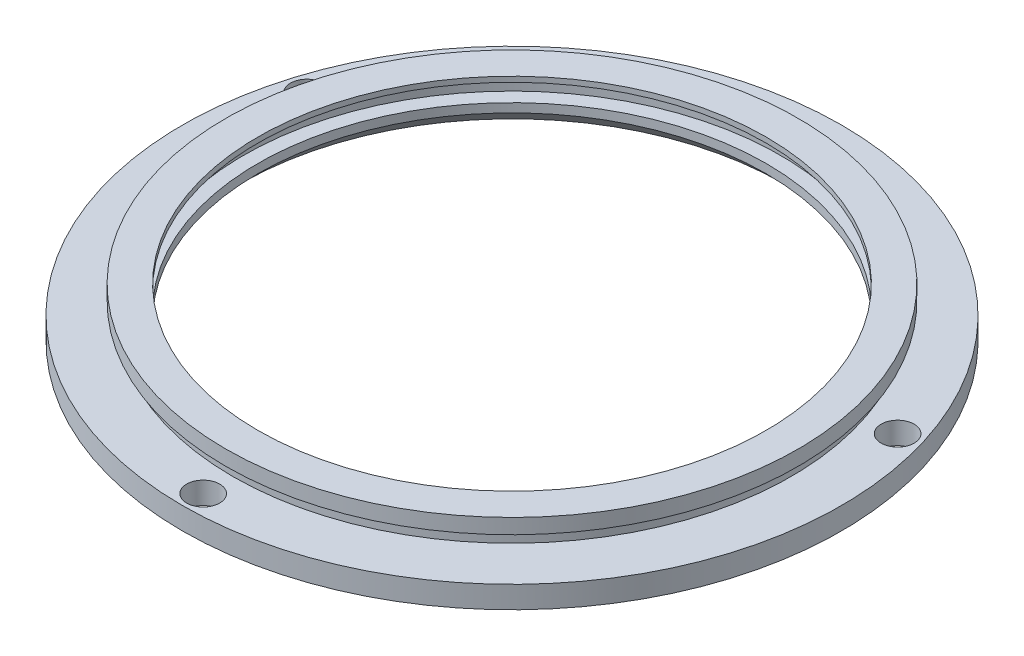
ISO-10303-21;
HEADER;
FILE_DESCRIPTION(('STEP AP214'),'2;1');
FILE_NAME('part.step','',(''),(''),'','','');
FILE_SCHEMA(('AUTOMOTIVE_DESIGN { 1 0 10303 214 1 1 1 1 }'));
ENDSEC;
DATA;
#1=APPLICATION_CONTEXT('core data for automotive mechanical design processes');
#2=APPLICATION_PROTOCOL_DEFINITION('international standard','automotive_design',2000,#1);
#3=PRODUCT_CONTEXT('',#1,'mechanical');
#4=PRODUCT('Part','Part','',(#3));
#5=PRODUCT_RELATED_PRODUCT_CATEGORY('part','',(#4));
#6=PRODUCT_DEFINITION_FORMATION('','',#4);
#7=PRODUCT_DEFINITION_CONTEXT('part definition',#1,'design');
#8=PRODUCT_DEFINITION('design','',#6,#7);
#9=PRODUCT_DEFINITION_SHAPE('','',#8);
#10=(LENGTH_UNIT() NAMED_UNIT(*) SI_UNIT(.MILLI.,.METRE.));
#11=(NAMED_UNIT(*) PLANE_ANGLE_UNIT() SI_UNIT($,.RADIAN.));
#12=(NAMED_UNIT(*) SI_UNIT($,.STERADIAN.) SOLID_ANGLE_UNIT());
#13=UNCERTAINTY_MEASURE_WITH_UNIT(LENGTH_MEASURE(1.E-05),#10,'distance_accuracy_value','');
#14=(GEOMETRIC_REPRESENTATION_CONTEXT(3) GLOBAL_UNCERTAINTY_ASSIGNED_CONTEXT((#13)) GLOBAL_UNIT_ASSIGNED_CONTEXT((#10,
#11,#12)) REPRESENTATION_CONTEXT('',''));
#15=CARTESIAN_POINT('',(0.,0.,0.));
#16=DIRECTION('',(0.,0.,1.));
#17=DIRECTION('',(1.,0.,0.));
#18=AXIS2_PLACEMENT_3D('',#15,#16,#17);
#19=CARTESIAN_POINT('',(-36.6036068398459,-50.800000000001,-152.37547918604));
#20=DIRECTION('',(0.,1.,0.));
#21=DIRECTION('',(0.,0.,1.));
#22=AXIS2_PLACEMENT_3D('',#19,#20,#21);
#23=PLANE('',#22);
#24=CARTESIAN_POINT('',(-0.0250668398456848,-50.800000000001,-152.37547918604));
#25=DIRECTION('',(0.,1.,0.));
#26=DIRECTION('',(0.,0.,1.));
#27=AXIS2_PLACEMENT_3D('',#24,#25,#26);
#28=CIRCLE('',#27,36.57854);
#29=CARTESIAN_POINT('',(-0.0250668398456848,-50.800000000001,-115.79693918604));
#30=VERTEX_POINT('',#29);
#31=EDGE_CURVE('E18',#30,#30,#28,.F.);
#32=ORIENTED_EDGE('',*,*,#31,.T.);
#33=EDGE_LOOP('',(#32));
#34=FACE_BOUND('',#33,.T.);
#35=CARTESIAN_POINT('',(-0.0250668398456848,-50.800000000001,-152.37547918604));
#36=DIRECTION('',(0.,1.,0.));
#37=DIRECTION('',(0.,0.,1.));
#38=AXIS2_PLACEMENT_3D('',#35,#36,#37);
#39=CIRCLE('',#38,41.2115);
#40=CARTESIAN_POINT('',(-0.0250668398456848,-50.800000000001,-111.16397918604));
#41=VERTEX_POINT('',#40);
#42=EDGE_CURVE('E72',#41,#41,#39,.F.);
#43=ORIENTED_EDGE('',*,*,#42,.F.);
#44=EDGE_LOOP('',(#43));
#45=FACE_BOUND('',#44,.T.);
#46=ADVANCED_FACE('F15',(#34,#45),#23,.T.);
#47=CARTESIAN_POINT('',(-0.0250668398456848,-51.179536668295,-152.37547918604));
#48=DIRECTION('',(0.,1.,0.));
#49=DIRECTION('',(0.,0.,1.));
#50=AXIS2_PLACEMENT_3D('',#47,#48,#49);
#51=CYLINDRICAL_SURFACE('',#50,36.57854);
#52=CARTESIAN_POINT('',(-0.0250668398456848,-51.5590733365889,-152.37547918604));
#53=DIRECTION('',(0.,1.,0.));
#54=DIRECTION('',(0.,0.,1.));
#55=AXIS2_PLACEMENT_3D('',#52,#53,#54);
#56=CIRCLE('',#55,36.57854);
#57=CARTESIAN_POINT('',(-0.0250668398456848,-51.5590733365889,-115.79693918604));
#58=VERTEX_POINT('',#57);
#59=EDGE_CURVE('E70',#58,#58,#56,.T.);
#60=ORIENTED_EDGE('',*,*,#59,.F.);
#61=EDGE_LOOP('',(#60));
#62=FACE_BOUND('',#61,.T.);
#63=ORIENTED_EDGE('',*,*,#31,.F.);
#64=EDGE_LOOP('',(#63));
#65=FACE_BOUND('',#64,.T.);
#66=ADVANCED_FACE('F81',(#62,#65),#51,.F.);
#67=CARTESIAN_POINT('',(-0.0250668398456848,-51.879500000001,-152.37547918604));
#68=DIRECTION('',(0.,1.,0.));
#69=DIRECTION('',(0.,0.,1.));
#70=AXIS2_PLACEMENT_3D('',#67,#68,#69);
#71=CYLINDRICAL_SURFACE('',#70,41.2115);
#72=CARTESIAN_POINT('',(-0.0250668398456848,-52.9590000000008,-152.37547918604));
#73=DIRECTION('',(0.,1.,0.));
#74=DIRECTION('',(0.,0.,1.));
#75=AXIS2_PLACEMENT_3D('',#72,#73,#74);
#76=CIRCLE('',#75,41.2115);
#77=CARTESIAN_POINT('',(-0.0250668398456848,-52.9590000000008,-111.16397918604));
#78=VERTEX_POINT('',#77);
#79=EDGE_CURVE('E67',#78,#78,#76,.F.);
#80=ORIENTED_EDGE('',*,*,#79,.F.);
#81=EDGE_LOOP('',(#80));
#82=FACE_BOUND('',#81,.T.);
#83=ORIENTED_EDGE('',*,*,#42,.T.);
#84=EDGE_LOOP('',(#83));
#85=FACE_BOUND('',#84,.T.);
#86=ADVANCED_FACE('F83',(#82,#85),#71,.T.);
#87=CARTESIAN_POINT('',(-38.6457668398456,-51.5590733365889,-152.37547918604));
#88=DIRECTION('',(0.,-1.,0.));
#89=DIRECTION('',(0.,0.,-1.));
#90=AXIS2_PLACEMENT_3D('',#87,#88,#89);
#91=PLANE('',#90);
#92=ORIENTED_EDGE('',*,*,#59,.T.);
#93=EDGE_LOOP('',(#92));
#94=FACE_BOUND('',#93,.T.);
#95=CARTESIAN_POINT('',(-0.0250668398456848,-51.5590733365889,-152.37547918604));
#96=DIRECTION('',(0.,1.,0.));
#97=DIRECTION('',(0.,0.,1.));
#98=AXIS2_PLACEMENT_3D('',#95,#96,#97);
#99=CIRCLE('',#98,38.6207);
#100=CARTESIAN_POINT('',(-0.0250668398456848,-51.5590733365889,-113.75477918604));
#101=VERTEX_POINT('',#100);
#102=EDGE_CURVE('E64',#101,#101,#99,.F.);
#103=ORIENTED_EDGE('',*,*,#102,.T.);
#104=EDGE_LOOP('',(#103));
#105=FACE_BOUND('',#104,.T.);
#106=ADVANCED_FACE('F90',(#94,#105),#91,.T.);
#107=CARTESIAN_POINT('',(-41.2365668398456,-52.9590000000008,-152.37547918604));
#108=DIRECTION('',(0.,-1.,0.));
#109=DIRECTION('',(0.,0.,-1.));
#110=AXIS2_PLACEMENT_3D('',#107,#108,#109);
#111=PLANE('',#110);
#112=CARTESIAN_POINT('',(-0.0250668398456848,-52.9590000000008,-152.37547918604));
#113=DIRECTION('',(0.,1.,0.));
#114=DIRECTION('',(0.,0.,1.));
#115=AXIS2_PLACEMENT_3D('',#112,#113,#114);
#116=CIRCLE('',#115,40.1955);
#117=CARTESIAN_POINT('',(-0.0250668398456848,-52.9590000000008,-112.17997918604));
#118=VERTEX_POINT('',#117);
#119=EDGE_CURVE('E61',#118,#118,#116,.F.);
#120=ORIENTED_EDGE('',*,*,#119,.F.);
#121=EDGE_LOOP('',(#120));
#122=FACE_BOUND('',#121,.T.);
#123=ORIENTED_EDGE('',*,*,#79,.T.);
#124=EDGE_LOOP('',(#123));
#125=FACE_BOUND('',#124,.T.);
#126=ADVANCED_FACE('F140',(#122,#125),#111,.T.);
#127=CARTESIAN_POINT('',(-0.0250668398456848,-52.8290733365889,-152.37547918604));
#128=DIRECTION('',(0.,1.,0.));
#129=DIRECTION('',(0.,0.,1.));
#130=AXIS2_PLACEMENT_3D('',#127,#128,#129);
#131=CYLINDRICAL_SURFACE('',#130,38.6207);
#132=CARTESIAN_POINT('',(-0.0250668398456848,-54.0990733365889,-152.37547918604));
#133=DIRECTION('',(0.,1.,0.));
#134=DIRECTION('',(0.,0.,1.));
#135=AXIS2_PLACEMENT_3D('',#132,#133,#134);
#136=CIRCLE('',#135,38.6207);
#137=CARTESIAN_POINT('',(-0.0250668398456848,-54.0990733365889,-113.75477918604));
#138=VERTEX_POINT('',#137);
#139=EDGE_CURVE('E58',#138,#138,#136,.T.);
#140=ORIENTED_EDGE('',*,*,#139,.F.);
#141=EDGE_LOOP('',(#140));
#142=FACE_BOUND('',#141,.T.);
#143=ORIENTED_EDGE('',*,*,#102,.F.);
#144=EDGE_LOOP('',(#143));
#145=FACE_BOUND('',#144,.T.);
#146=ADVANCED_FACE('F136',(#142,#145),#131,.F.);
#147=CARTESIAN_POINT('',(-0.0250668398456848,-53.8480000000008,-152.37547918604));
#148=DIRECTION('',(0.,1.,0.));
#149=DIRECTION('',(0.,0.,1.));
#150=AXIS2_PLACEMENT_3D('',#147,#148,#149);
#151=CYLINDRICAL_SURFACE('',#150,40.1955);
#152=CARTESIAN_POINT('',(-0.0250668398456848,-54.7370000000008,-152.37547918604));
#153=DIRECTION('',(0.,1.,0.));
#154=DIRECTION('',(0.,0.,1.));
#155=AXIS2_PLACEMENT_3D('',#152,#153,#154);
#156=CIRCLE('',#155,40.1955);
#157=CARTESIAN_POINT('',(-0.0250668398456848,-54.7370000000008,-112.17997918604));
#158=VERTEX_POINT('',#157);
#159=EDGE_CURVE('E55',#158,#158,#156,.F.);
#160=ORIENTED_EDGE('',*,*,#159,.F.);
#161=EDGE_LOOP('',(#160));
#162=FACE_BOUND('',#161,.T.);
#163=ORIENTED_EDGE('',*,*,#119,.T.);
#164=EDGE_LOOP('',(#163));
#165=FACE_BOUND('',#164,.T.);
#166=ADVANCED_FACE('F132',(#162,#165),#151,.T.);
#167=CARTESIAN_POINT('',(-36.6036068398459,-54.0990733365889,-152.37547918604));
#168=DIRECTION('',(0.,1.,0.));
#169=DIRECTION('',(0.,0.,1.));
#170=AXIS2_PLACEMENT_3D('',#167,#168,#169);
#171=PLANE('',#170);
#172=CARTESIAN_POINT('',(-0.0250668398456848,-54.0990733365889,-152.37547918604));
#173=DIRECTION('',(0.,1.,0.));
#174=DIRECTION('',(0.,0.,1.));
#175=AXIS2_PLACEMENT_3D('',#172,#173,#174);
#176=CIRCLE('',#175,36.57854);
#177=CARTESIAN_POINT('',(-0.0250668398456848,-54.0990733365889,-115.79693918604));
#178=VERTEX_POINT('',#177);
#179=EDGE_CURVE('E52',#178,#178,#176,.F.);
#180=ORIENTED_EDGE('',*,*,#179,.T.);
#181=EDGE_LOOP('',(#180));
#182=FACE_BOUND('',#181,.T.);
#183=ORIENTED_EDGE('',*,*,#139,.T.);
#184=EDGE_LOOP('',(#183));
#185=FACE_BOUND('',#184,.T.);
#186=ADVANCED_FACE('F128',(#182,#185),#171,.T.);
#187=CARTESIAN_POINT('',(-40.2205668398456,-54.7370000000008,-152.37547918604));
#188=DIRECTION('',(0.,1.,0.));
#189=DIRECTION('',(0.,0.,1.));
#190=AXIS2_PLACEMENT_3D('',#187,#188,#189);
#191=PLANE('',#190);
#192=ORIENTED_EDGE('',*,*,#159,.T.);
#193=EDGE_LOOP('',(#192));
#194=FACE_BOUND('',#193,.T.);
#195=CARTESIAN_POINT('',(-42.5328132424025,-54.7370000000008,-165.371401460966));
#196=DIRECTION('',(0.,1.,0.));
#197=DIRECTION('',(-1.,0.,0.));
#198=AXIS2_PLACEMENT_3D('',#195,#196,#197);
#199=CIRCLE('',#198,2.3749);
#200=CARTESIAN_POINT('',(-44.9077132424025,-54.7370000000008,-165.371401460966));
#201=VERTEX_POINT('',#200);
#202=EDGE_CURVE('E40',#201,#201,#199,.F.);
#203=ORIENTED_EDGE('',*,*,#202,.T.);
#204=EDGE_LOOP('',(#203));
#205=FACE_BOUND('',#204,.T.);
#206=CARTESIAN_POINT('',(-0.0250668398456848,-54.7370000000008,-107.92547918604));
#207=DIRECTION('',(0.,1.,0.));
#208=DIRECTION('',(-1.,0.,0.));
#209=AXIS2_PLACEMENT_3D('',#206,#207,#208);
#210=CIRCLE('',#209,2.3749);
#211=CARTESIAN_POINT('',(-2.39996683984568,-54.7370000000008,-107.92547918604));
#212=VERTEX_POINT('',#211);
#213=EDGE_CURVE('E43',#212,#212,#210,.F.);
#214=ORIENTED_EDGE('',*,*,#213,.T.);
#215=EDGE_LOOP('',(#214));
#216=FACE_BOUND('',#215,.T.);
#217=CARTESIAN_POINT('',(42.4826795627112,-54.7370000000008,-165.371401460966));
#218=DIRECTION('',(0.,1.,0.));
#219=DIRECTION('',(-1.,0.,0.));
#220=AXIS2_PLACEMENT_3D('',#217,#218,#219);
#221=CIRCLE('',#220,2.3749);
#222=CARTESIAN_POINT('',(40.1077795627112,-54.7370000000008,-165.371401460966));
#223=VERTEX_POINT('',#222);
#224=EDGE_CURVE('E46',#223,#223,#221,.F.);
#225=ORIENTED_EDGE('',*,*,#224,.T.);
#226=EDGE_LOOP('',(#225));
#227=FACE_BOUND('',#226,.T.);
#228=CARTESIAN_POINT('',(-0.0250668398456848,-54.7370000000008,-152.37547918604));
#229=DIRECTION('',(0.,1.,0.));
#230=DIRECTION('',(0.,0.,1.));
#231=AXIS2_PLACEMENT_3D('',#228,#229,#230);
#232=CIRCLE('',#231,47.4345);
#233=CARTESIAN_POINT('',(-0.0250668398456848,-54.7370000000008,-104.94097918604));
#234=VERTEX_POINT('',#233);
#235=EDGE_CURVE('E49',#234,#234,#232,.F.);
#236=ORIENTED_EDGE('',*,*,#235,.F.);
#237=EDGE_LOOP('',(#236));
#238=FACE_BOUND('',#237,.T.);
#239=ADVANCED_FACE('F124',(#194,#205,#216,#227,#238),#191,.T.);
#240=CARTESIAN_POINT('',(-0.0250668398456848,-54.735536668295,-152.37547918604));
#241=DIRECTION('',(0.,1.,0.));
#242=DIRECTION('',(0.,0.,1.));
#243=AXIS2_PLACEMENT_3D('',#240,#241,#242);
#244=CYLINDRICAL_SURFACE('',#243,36.57854);
#245=CARTESIAN_POINT('',(-0.0250668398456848,-55.3720000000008,-152.37547918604));
#246=DIRECTION('',(0.,-1.,0.));
#247=DIRECTION('',(-1.,0.,0.));
#248=AXIS2_PLACEMENT_3D('',#245,#246,#247);
#249=CIRCLE('',#248,36.57854);
#250=CARTESIAN_POINT('',(-36.6036068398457,-55.3720000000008,-152.37547918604));
#251=VERTEX_POINT('',#250);
#252=EDGE_CURVE('E30',#251,#251,#249,.T.);
#253=ORIENTED_EDGE('',*,*,#252,.T.);
#254=EDGE_LOOP('',(#253));
#255=FACE_BOUND('',#254,.T.);
#256=ORIENTED_EDGE('',*,*,#179,.F.);
#257=EDGE_LOOP('',(#256));
#258=FACE_BOUND('',#257,.T.);
#259=ADVANCED_FACE('F120',(#255,#258),#244,.F.);
#260=CARTESIAN_POINT('',(-0.0250668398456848,-56.3245000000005,-152.37547918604));
#261=DIRECTION('',(0.,1.,0.));
#262=DIRECTION('',(0.,0.,1.));
#263=AXIS2_PLACEMENT_3D('',#260,#261,#262);
#264=CYLINDRICAL_SURFACE('',#263,47.4345);
#265=CARTESIAN_POINT('',(-0.0250668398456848,-57.912,-152.37547918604));
#266=DIRECTION('',(0.,1.,0.));
#267=DIRECTION('',(0.,0.,1.));
#268=AXIS2_PLACEMENT_3D('',#265,#266,#267);
#269=CIRCLE('',#268,47.4345);
#270=CARTESIAN_POINT('',(-0.0250668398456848,-57.912,-104.94097918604));
#271=VERTEX_POINT('',#270);
#272=EDGE_CURVE('E37',#271,#271,#269,.F.);
#273=ORIENTED_EDGE('',*,*,#272,.F.);
#274=EDGE_LOOP('',(#273));
#275=FACE_BOUND('',#274,.T.);
#276=ORIENTED_EDGE('',*,*,#235,.T.);
#277=EDGE_LOOP('',(#276));
#278=FACE_BOUND('',#277,.T.);
#279=ADVANCED_FACE('F116',(#275,#278),#264,.T.);
#280=CARTESIAN_POINT('',(42.4826795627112,-57.912,-165.371401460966));
#281=DIRECTION('',(0.,1.,0.));
#282=DIRECTION('',(-1.,0.,0.));
#283=AXIS2_PLACEMENT_3D('',#280,#281,#282);
#284=CYLINDRICAL_SURFACE('',#283,2.3749);
#285=ORIENTED_EDGE('',*,*,#224,.F.);
#286=EDGE_LOOP('',(#285));
#287=FACE_BOUND('',#286,.T.);
#288=CARTESIAN_POINT('',(42.4826795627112,-57.912,-165.371401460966));
#289=DIRECTION('',(0.,1.,0.));
#290=DIRECTION('',(-1.,0.,0.));
#291=AXIS2_PLACEMENT_3D('',#288,#289,#290);
#292=CIRCLE('',#291,2.3749);
#293=CARTESIAN_POINT('',(40.1077795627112,-57.912,-165.371401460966));
#294=VERTEX_POINT('',#293);
#295=EDGE_CURVE('E34',#294,#294,#292,.T.);
#296=ORIENTED_EDGE('',*,*,#295,.F.);
#297=EDGE_LOOP('',(#296));
#298=FACE_BOUND('',#297,.T.);
#299=ADVANCED_FACE('F112',(#287,#298),#284,.F.);
#300=CARTESIAN_POINT('',(-0.0250668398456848,-57.912,-107.92547918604));
#301=DIRECTION('',(0.,1.,0.));
#302=DIRECTION('',(-1.,0.,0.));
#303=AXIS2_PLACEMENT_3D('',#300,#301,#302);
#304=CYLINDRICAL_SURFACE('',#303,2.3749);
#305=ORIENTED_EDGE('',*,*,#213,.F.);
#306=EDGE_LOOP('',(#305));
#307=FACE_BOUND('',#306,.T.);
#308=CARTESIAN_POINT('',(-0.0250668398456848,-57.912,-107.92547918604));
#309=DIRECTION('',(0.,1.,0.));
#310=DIRECTION('',(-1.,0.,0.));
#311=AXIS2_PLACEMENT_3D('',#308,#309,#310);
#312=CIRCLE('',#311,2.3749);
#313=CARTESIAN_POINT('',(-2.39996683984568,-57.912,-107.92547918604));
#314=VERTEX_POINT('',#313);
#315=EDGE_CURVE('E27',#314,#314,#312,.T.);
#316=ORIENTED_EDGE('',*,*,#315,.F.);
#317=EDGE_LOOP('',(#316));
#318=FACE_BOUND('',#317,.T.);
#319=ADVANCED_FACE('F108',(#307,#318),#304,.F.);
#320=CARTESIAN_POINT('',(-42.5328132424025,-57.912,-165.371401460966));
#321=DIRECTION('',(0.,1.,0.));
#322=DIRECTION('',(-1.,0.,0.));
#323=AXIS2_PLACEMENT_3D('',#320,#321,#322);
#324=CYLINDRICAL_SURFACE('',#323,2.3749);
#325=ORIENTED_EDGE('',*,*,#202,.F.);
#326=EDGE_LOOP('',(#325));
#327=FACE_BOUND('',#326,.T.);
#328=CARTESIAN_POINT('',(-42.5328132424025,-57.912,-165.371401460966));
#329=DIRECTION('',(0.,1.,0.));
#330=DIRECTION('',(-1.,0.,0.));
#331=AXIS2_PLACEMENT_3D('',#328,#329,#330);
#332=CIRCLE('',#331,2.3749);
#333=CARTESIAN_POINT('',(-44.9077132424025,-57.912,-165.371401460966));
#334=VERTEX_POINT('',#333);
#335=EDGE_CURVE('E22',#334,#334,#332,.T.);
#336=ORIENTED_EDGE('',*,*,#335,.F.);
#337=EDGE_LOOP('',(#336));
#338=FACE_BOUND('',#337,.T.);
#339=ADVANCED_FACE('F101',(#327,#338),#324,.F.);
#340=CARTESIAN_POINT('',(-0.0250668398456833,-57.912,-152.37547918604));
#341=DIRECTION('',(0.,-1.,0.));
#342=DIRECTION('',(0.,0.,-1.));
#343=AXIS2_PLACEMENT_3D('',#340,#341,#342);
#344=CONICAL_SURFACE('',#343,39.1185399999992,0.785398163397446);
#345=CARTESIAN_POINT('',(-0.0250668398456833,-57.912,-152.37547918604));
#346=DIRECTION('',(0.,-1.,0.));
#347=DIRECTION('',(0.,0.,-1.));
#348=AXIS2_PLACEMENT_3D('',#345,#346,#347);
#349=CIRCLE('',#348,39.1185399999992);
#350=CARTESIAN_POINT('',(-0.0250668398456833,-57.912,-191.494019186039));
#351=VERTEX_POINT('',#350);
#352=EDGE_CURVE('E10',#351,#351,#349,.F.);
#353=ORIENTED_EDGE('',*,*,#352,.F.);
#354=EDGE_LOOP('',(#353));
#355=FACE_BOUND('',#354,.T.);
#356=ORIENTED_EDGE('',*,*,#252,.F.);
#357=EDGE_LOOP('',(#356));
#358=FACE_BOUND('',#357,.T.);
#359=ADVANCED_FACE('F96',(#355,#358),#344,.F.);
#360=CARTESIAN_POINT('',(-47.4595668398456,-57.912,-152.37547918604));
#361=DIRECTION('',(0.,-1.,0.));
#362=DIRECTION('',(0.,0.,-1.));
#363=AXIS2_PLACEMENT_3D('',#360,#361,#362);
#364=PLANE('',#363);
#365=ORIENTED_EDGE('',*,*,#352,.T.);
#366=EDGE_LOOP('',(#365));
#367=FACE_BOUND('',#366,.T.);
#368=ORIENTED_EDGE('',*,*,#335,.T.);
#369=EDGE_LOOP('',(#368));
#370=FACE_BOUND('',#369,.T.);
#371=ORIENTED_EDGE('',*,*,#315,.T.);
#372=EDGE_LOOP('',(#371));
#373=FACE_BOUND('',#372,.T.);
#374=ORIENTED_EDGE('',*,*,#295,.T.);
#375=EDGE_LOOP('',(#374));
#376=FACE_BOUND('',#375,.T.);
#377=ORIENTED_EDGE('',*,*,#272,.T.);
#378=EDGE_LOOP('',(#377));
#379=FACE_BOUND('',#378,.T.);
#380=ADVANCED_FACE('F94',(#367,#370,#373,#376,#379),#364,.T.);
#381=CLOSED_SHELL('',(#46,#66,#86,#106,#126,#146,#166,#186,#239,#259,#279,#299,#319,#339,#359,#380));
#382=MANIFOLD_SOLID_BREP('B1',#381);
#383=ADVANCED_BREP_SHAPE_REPRESENTATION('',(#18,#382),#14);
#384=SHAPE_DEFINITION_REPRESENTATION(#9,#383);
ENDSEC;
END-ISO-10303-21;
